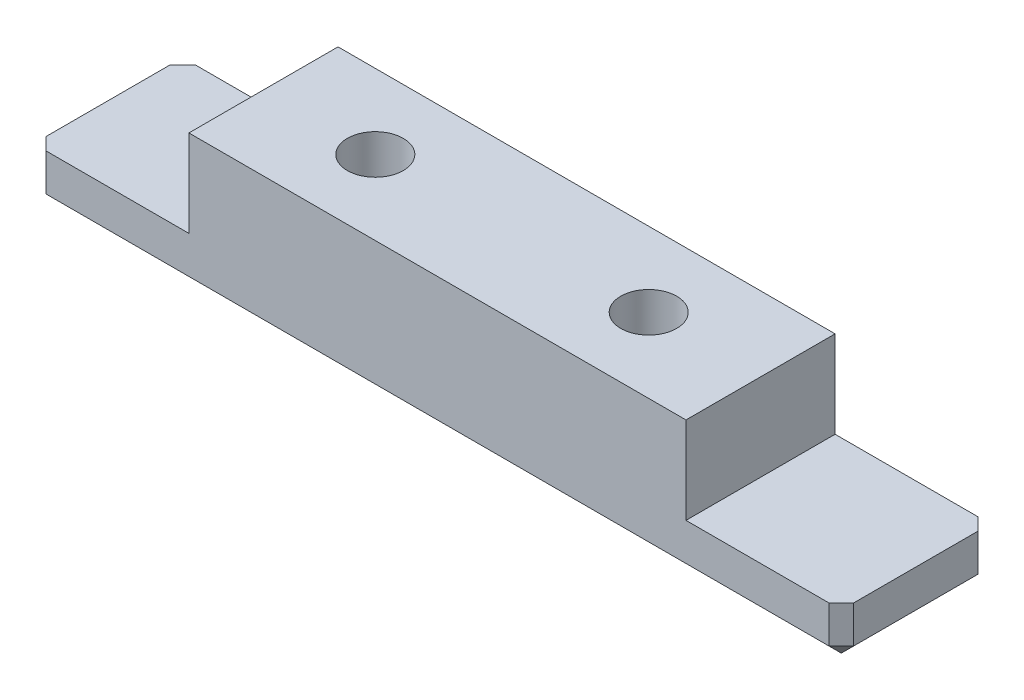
ISO-10303-21;
HEADER;
FILE_DESCRIPTION(('STEP AP214'),'2;1');
FILE_NAME('part.step','',(''),(''),'','','');
FILE_SCHEMA(('AUTOMOTIVE_DESIGN { 1 0 10303 214 1 1 1 1 }'));
ENDSEC;
DATA;
#1=APPLICATION_CONTEXT('core data for automotive mechanical design processes');
#2=APPLICATION_PROTOCOL_DEFINITION('international standard','automotive_design',2000,#1);
#3=PRODUCT_CONTEXT('',#1,'mechanical');
#4=PRODUCT('Part','Part','',(#3));
#5=PRODUCT_RELATED_PRODUCT_CATEGORY('part','',(#4));
#6=PRODUCT_DEFINITION_FORMATION('','',#4);
#7=PRODUCT_DEFINITION_CONTEXT('part definition',#1,'design');
#8=PRODUCT_DEFINITION('design','',#6,#7);
#9=PRODUCT_DEFINITION_SHAPE('','',#8);
#10=(LENGTH_UNIT() NAMED_UNIT(*) SI_UNIT(.MILLI.,.METRE.));
#11=(NAMED_UNIT(*) PLANE_ANGLE_UNIT() SI_UNIT($,.RADIAN.));
#12=(NAMED_UNIT(*) SI_UNIT($,.STERADIAN.) SOLID_ANGLE_UNIT());
#13=UNCERTAINTY_MEASURE_WITH_UNIT(LENGTH_MEASURE(1.E-05),#10,'distance_accuracy_value','');
#14=(GEOMETRIC_REPRESENTATION_CONTEXT(3) GLOBAL_UNCERTAINTY_ASSIGNED_CONTEXT((#13)) GLOBAL_UNIT_ASSIGNED_CONTEXT((#10,
#11,#12)) REPRESENTATION_CONTEXT('',''));
#15=CARTESIAN_POINT('',(0.,0.,0.));
#16=DIRECTION('',(0.,0.,1.));
#17=DIRECTION('',(1.,0.,0.));
#18=AXIS2_PLACEMENT_3D('',#15,#16,#17);
#19=CARTESIAN_POINT('',(20.,-7.,6.00000000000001));
#20=DIRECTION('',(0.,-1.,0.));
#21=DIRECTION('',(0.,0.,-1.));
#22=AXIS2_PLACEMENT_3D('',#19,#20,#21);
#23=PLANE('',#22);
#24=DIRECTION('',(-1.,0.,0.));
#25=VECTOR('',#24,1.);
#26=CARTESIAN_POINT('',(20.,-7.,6.00000000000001));
#27=LINE('',#26,#25);
#28=CARTESIAN_POINT('',(31.5,-7.,6.00000000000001));
#29=VERTEX_POINT('',#28);
#30=CARTESIAN_POINT('',(20.,-7.,6.00000000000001));
#31=VERTEX_POINT('',#30);
#32=EDGE_CURVE('E265',#29,#31,#27,.T.);
#33=ORIENTED_EDGE('',*,*,#32,.F.);
#34=DIRECTION('',(-0.70710678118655,0.,0.707106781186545));
#35=VECTOR('',#34,1.);
#36=CARTESIAN_POINT('',(31.5,-7.,6.00000000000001));
#37=LINE('',#36,#35);
#38=CARTESIAN_POINT('',(32.5,-7.,5.));
#39=VERTEX_POINT('',#38);
#40=EDGE_CURVE('E190',#29,#39,#37,.F.);
#41=ORIENTED_EDGE('',*,*,#40,.T.);
#42=DIRECTION('',(0.,0.,-1.));
#43=VECTOR('',#42,1.);
#44=CARTESIAN_POINT('',(32.5,-7.,6.00000000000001));
#45=LINE('',#44,#43);
#46=CARTESIAN_POINT('',(32.5,-7.,-4.99999999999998));
#47=VERTEX_POINT('',#46);
#48=EDGE_CURVE('E209',#39,#47,#45,.T.);
#49=ORIENTED_EDGE('',*,*,#48,.T.);
#50=DIRECTION('',(-0.707106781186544,0.,-0.707106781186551));
#51=VECTOR('',#50,1.);
#52=CARTESIAN_POINT('',(32.5,-7.,-4.99999999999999));
#53=LINE('',#52,#51);
#54=CARTESIAN_POINT('',(31.5,-7.,-6.00000000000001));
#55=VERTEX_POINT('',#54);
#56=EDGE_CURVE('E136',#47,#55,#53,.T.);
#57=ORIENTED_EDGE('',*,*,#56,.T.);
#58=DIRECTION('',(-1.,0.,0.));
#59=VECTOR('',#58,1.);
#60=CARTESIAN_POINT('',(20.,-7.,-6.00000000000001));
#61=LINE('',#60,#59);
#62=CARTESIAN_POINT('',(20.,-7.,-6.00000000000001));
#63=VERTEX_POINT('',#62);
#64=EDGE_CURVE('E129',#55,#63,#61,.T.);
#65=ORIENTED_EDGE('',*,*,#64,.T.);
#66=DIRECTION('',(0.,0.,-1.));
#67=VECTOR('',#66,1.);
#68=CARTESIAN_POINT('',(20.,-7.,6.00000000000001));
#69=LINE('',#68,#67);
#70=EDGE_CURVE('E133',#31,#63,#69,.T.);
#71=ORIENTED_EDGE('',*,*,#70,.F.);
#72=EDGE_LOOP('',(#33,#41,#49,#57,#65,#71));
#73=FACE_BOUND('',#72,.T.);
#74=ADVANCED_FACE('F31',(#73),#23,.F.);
#75=CARTESIAN_POINT('',(20.,0.,6.00000000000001));
#76=DIRECTION('',(-1.,0.,0.));
#77=DIRECTION('',(0.,0.,1.));
#78=AXIS2_PLACEMENT_3D('',#75,#76,#77);
#79=PLANE('',#78);
#80=DIRECTION('',(0.,1.,0.));
#81=VECTOR('',#80,1.);
#82=CARTESIAN_POINT('',(20.,0.,-6.00000000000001));
#83=LINE('',#82,#81);
#84=CARTESIAN_POINT('',(20.,0.,-6.00000000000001));
#85=VERTEX_POINT('',#84);
#86=EDGE_CURVE('E137',#63,#85,#83,.T.);
#87=ORIENTED_EDGE('',*,*,#86,.T.);
#88=DIRECTION('',(0.,0.,-1.));
#89=VECTOR('',#88,1.);
#90=CARTESIAN_POINT('',(20.,0.,6.00000000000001));
#91=LINE('',#90,#89);
#92=CARTESIAN_POINT('',(20.,0.,6.00000000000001));
#93=VERTEX_POINT('',#92);
#94=EDGE_CURVE('E152',#93,#85,#91,.T.);
#95=ORIENTED_EDGE('',*,*,#94,.F.);
#96=DIRECTION('',(0.,1.,0.));
#97=VECTOR('',#96,1.);
#98=CARTESIAN_POINT('',(20.,0.,6.00000000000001));
#99=LINE('',#98,#97);
#100=EDGE_CURVE('E150',#31,#93,#99,.T.);
#101=ORIENTED_EDGE('',*,*,#100,.F.);
#102=ORIENTED_EDGE('',*,*,#70,.T.);
#103=EDGE_LOOP('',(#87,#95,#101,#102));
#104=FACE_BOUND('',#103,.T.);
#105=ADVANCED_FACE('F149',(#104),#79,.F.);
#106=CARTESIAN_POINT('',(-20.,0.,6.00000000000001));
#107=DIRECTION('',(0.,-1.,0.));
#108=DIRECTION('',(1.,0.,0.));
#109=AXIS2_PLACEMENT_3D('',#106,#107,#108);
#110=PLANE('',#109);
#111=CARTESIAN_POINT('',(-11.,0.,0.));
#112=DIRECTION('',(0.,-1.,0.));
#113=DIRECTION('',(0.,0.,-1.));
#114=AXIS2_PLACEMENT_3D('',#111,#112,#113);
#115=CIRCLE('',#114,2.25);
#116=CARTESIAN_POINT('',(-11.,0.,-2.25));
#117=VERTEX_POINT('',#116);
#118=EDGE_CURVE('E464',#117,#117,#115,.T.);
#119=ORIENTED_EDGE('',*,*,#118,.T.);
#120=EDGE_LOOP('',(#119));
#121=FACE_BOUND('',#120,.T.);
#122=CARTESIAN_POINT('',(11.,0.,0.));
#123=DIRECTION('',(0.,-1.,0.));
#124=DIRECTION('',(0.,0.,-1.));
#125=AXIS2_PLACEMENT_3D('',#122,#123,#124);
#126=CIRCLE('',#125,2.25);
#127=CARTESIAN_POINT('',(11.,0.,-2.25));
#128=VERTEX_POINT('',#127);
#129=EDGE_CURVE('E234',#128,#128,#126,.T.);
#130=ORIENTED_EDGE('',*,*,#129,.T.);
#131=EDGE_LOOP('',(#130));
#132=FACE_BOUND('',#131,.T.);
#133=DIRECTION('',(-1.,0.,0.));
#134=VECTOR('',#133,1.);
#135=CARTESIAN_POINT('',(-20.,0.,-6.00000000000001));
#136=LINE('',#135,#134);
#137=CARTESIAN_POINT('',(-20.,0.,-6.00000000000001));
#138=VERTEX_POINT('',#137);
#139=EDGE_CURVE('E143',#85,#138,#136,.T.);
#140=ORIENTED_EDGE('',*,*,#139,.T.);
#141=DIRECTION('',(0.,0.,-1.));
#142=VECTOR('',#141,1.);
#143=CARTESIAN_POINT('',(-20.,0.,6.00000000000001));
#144=LINE('',#143,#142);
#145=CARTESIAN_POINT('',(-20.,0.,6.00000000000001));
#146=VERTEX_POINT('',#145);
#147=EDGE_CURVE('E156',#146,#138,#144,.T.);
#148=ORIENTED_EDGE('',*,*,#147,.F.);
#149=DIRECTION('',(-1.,0.,0.));
#150=VECTOR('',#149,1.);
#151=CARTESIAN_POINT('',(-20.,0.,6.00000000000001));
#152=LINE('',#151,#150);
#153=EDGE_CURVE('E268',#93,#146,#152,.T.);
#154=ORIENTED_EDGE('',*,*,#153,.F.);
#155=ORIENTED_EDGE('',*,*,#94,.T.);
#156=EDGE_LOOP('',(#140,#148,#154,#155));
#157=FACE_BOUND('',#156,.T.);
#158=ADVANCED_FACE('F284',(#121,#132,#157),#110,.F.);
#159=CARTESIAN_POINT('',(-20.,0.,6.00000000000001));
#160=DIRECTION('',(1.,0.,0.));
#161=DIRECTION('',(0.,0.,-1.));
#162=AXIS2_PLACEMENT_3D('',#159,#160,#161);
#163=PLANE('',#162);
#164=DIRECTION('',(0.,-1.,0.));
#165=VECTOR('',#164,1.);
#166=CARTESIAN_POINT('',(-20.,0.,-6.00000000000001));
#167=LINE('',#166,#165);
#168=CARTESIAN_POINT('',(-20.,-7.00000000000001,-6.00000000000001));
#169=VERTEX_POINT('',#168);
#170=EDGE_CURVE('E262',#138,#169,#167,.T.);
#171=ORIENTED_EDGE('',*,*,#170,.T.);
#172=DIRECTION('',(0.,0.,-1.));
#173=VECTOR('',#172,1.);
#174=CARTESIAN_POINT('',(-20.,-7.00000000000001,6.00000000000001));
#175=LINE('',#174,#173);
#176=CARTESIAN_POINT('',(-20.,-7.00000000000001,6.00000000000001));
#177=VERTEX_POINT('',#176);
#178=EDGE_CURVE('E208',#177,#169,#175,.T.);
#179=ORIENTED_EDGE('',*,*,#178,.F.);
#180=DIRECTION('',(0.,-1.,0.));
#181=VECTOR('',#180,1.);
#182=CARTESIAN_POINT('',(-20.,0.,6.00000000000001));
#183=LINE('',#182,#181);
#184=EDGE_CURVE('E270',#146,#177,#183,.T.);
#185=ORIENTED_EDGE('',*,*,#184,.F.);
#186=ORIENTED_EDGE('',*,*,#147,.T.);
#187=EDGE_LOOP('',(#171,#179,#185,#186));
#188=FACE_BOUND('',#187,.T.);
#189=ADVANCED_FACE('F280',(#188),#163,.F.);
#190=CARTESIAN_POINT('',(-20.,-7.00000000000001,6.00000000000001));
#191=DIRECTION('',(0.,-1.,0.));
#192=DIRECTION('',(1.,0.,0.));
#193=AXIS2_PLACEMENT_3D('',#190,#191,#192);
#194=PLANE('',#193);
#195=DIRECTION('',(0.,0.,-1.));
#196=VECTOR('',#195,1.);
#197=CARTESIAN_POINT('',(-32.5,-7.00000000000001,6.00000000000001));
#198=LINE('',#197,#196);
#199=CARTESIAN_POINT('',(-32.5,-7.00000000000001,4.99999999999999));
#200=VERTEX_POINT('',#199);
#201=CARTESIAN_POINT('',(-32.5,-7.00000000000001,-4.99999999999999));
#202=VERTEX_POINT('',#201);
#203=EDGE_CURVE('E197',#200,#202,#198,.T.);
#204=ORIENTED_EDGE('',*,*,#203,.F.);
#205=DIRECTION('',(-0.707106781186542,0.,-0.707106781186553));
#206=VECTOR('',#205,1.);
#207=CARTESIAN_POINT('',(-31.5,-7.00000000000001,6.00000000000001));
#208=LINE('',#207,#206);
#209=CARTESIAN_POINT('',(-31.5,-7.00000000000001,6.00000000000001));
#210=VERTEX_POINT('',#209);
#211=EDGE_CURVE('E11',#200,#210,#208,.F.);
#212=ORIENTED_EDGE('',*,*,#211,.T.);
#213=DIRECTION('',(-1.,0.,0.));
#214=VECTOR('',#213,1.);
#215=CARTESIAN_POINT('',(-20.,-7.00000000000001,6.00000000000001));
#216=LINE('',#215,#214);
#217=EDGE_CURVE('E272',#177,#210,#216,.T.);
#218=ORIENTED_EDGE('',*,*,#217,.F.);
#219=ORIENTED_EDGE('',*,*,#178,.T.);
#220=DIRECTION('',(-1.,0.,0.));
#221=VECTOR('',#220,1.);
#222=CARTESIAN_POINT('',(-20.,-7.00000000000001,-6.00000000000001));
#223=LINE('',#222,#221);
#224=CARTESIAN_POINT('',(-31.5,-7.00000000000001,-6.00000000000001));
#225=VERTEX_POINT('',#224);
#226=EDGE_CURVE('E201',#169,#225,#223,.T.);
#227=ORIENTED_EDGE('',*,*,#226,.T.);
#228=DIRECTION('',(-0.707106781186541,0.,0.707106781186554));
#229=VECTOR('',#228,1.);
#230=CARTESIAN_POINT('',(-32.5,-7.00000000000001,-4.99999999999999));
#231=LINE('',#230,#229);
#232=EDGE_CURVE('E38',#225,#202,#231,.T.);
#233=ORIENTED_EDGE('',*,*,#232,.T.);
#234=EDGE_LOOP('',(#204,#212,#218,#219,#227,#233));
#235=FACE_BOUND('',#234,.T.);
#236=ADVANCED_FACE('F196',(#235),#194,.F.);
#237=CARTESIAN_POINT('',(-32.5,-7.00000000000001,6.00000000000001));
#238=DIRECTION('',(1.,0.,0.));
#239=DIRECTION('',(0.,0.,-1.));
#240=AXIS2_PLACEMENT_3D('',#237,#238,#239);
#241=PLANE('',#240);
#242=DIRECTION('',(0.,0.,1.));
#243=VECTOR('',#242,1.);
#244=CARTESIAN_POINT('',(-32.5,-10.0048190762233,6.00000000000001));
#245=LINE('',#244,#243);
#246=CARTESIAN_POINT('',(-32.5,-10.0048190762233,-4.99999999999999));
#247=VERTEX_POINT('',#246);
#248=CARTESIAN_POINT('',(-32.5,-10.0048190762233,4.99999999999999));
#249=VERTEX_POINT('',#248);
#250=EDGE_CURVE('E168',#247,#249,#245,.T.);
#251=ORIENTED_EDGE('',*,*,#250,.T.);
#252=DIRECTION('',(0.,1.,0.));
#253=VECTOR('',#252,1.);
#254=CARTESIAN_POINT('',(-32.5,-7.00000000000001,4.99999999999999));
#255=LINE('',#254,#253);
#256=EDGE_CURVE('E171',#249,#200,#255,.T.);
#257=ORIENTED_EDGE('',*,*,#256,.T.);
#258=ORIENTED_EDGE('',*,*,#203,.T.);
#259=DIRECTION('',(0.,-1.,0.));
#260=VECTOR('',#259,1.);
#261=CARTESIAN_POINT('',(-32.5,-11.0048190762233,-4.99999999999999));
#262=LINE('',#261,#260);
#263=EDGE_CURVE('E166',#202,#247,#262,.T.);
#264=ORIENTED_EDGE('',*,*,#263,.T.);
#265=EDGE_LOOP('',(#251,#257,#258,#264));
#266=FACE_BOUND('',#265,.T.);
#267=ADVANCED_FACE('F205',(#266),#241,.F.);
#268=CARTESIAN_POINT('',(32.5,-11.0048190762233,6.00000000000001));
#269=DIRECTION('',(0.,1.,0.));
#270=DIRECTION('',(-1.,0.,0.));
#271=AXIS2_PLACEMENT_3D('',#268,#269,#270);
#272=PLANE('',#271);
#273=CARTESIAN_POINT('',(-11.,-11.0048190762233,0.));
#274=DIRECTION('',(0.,-1.,0.));
#275=DIRECTION('',(0.,0.,-1.));
#276=AXIS2_PLACEMENT_3D('',#273,#274,#275);
#277=CIRCLE('',#276,2.25);
#278=CARTESIAN_POINT('',(-11.,-11.0048190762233,-2.25));
#279=VERTEX_POINT('',#278);
#280=EDGE_CURVE('E467',#279,#279,#277,.T.);
#281=ORIENTED_EDGE('',*,*,#280,.F.);
#282=EDGE_LOOP('',(#281));
#283=FACE_BOUND('',#282,.T.);
#284=CARTESIAN_POINT('',(11.,-11.0048190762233,0.));
#285=DIRECTION('',(0.,-1.,0.));
#286=DIRECTION('',(0.,0.,-1.));
#287=AXIS2_PLACEMENT_3D('',#284,#285,#286);
#288=CIRCLE('',#287,2.25);
#289=CARTESIAN_POINT('',(11.,-11.0048190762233,-2.25));
#290=VERTEX_POINT('',#289);
#291=EDGE_CURVE('E230',#290,#290,#288,.T.);
#292=ORIENTED_EDGE('',*,*,#291,.F.);
#293=EDGE_LOOP('',(#292));
#294=FACE_BOUND('',#293,.T.);
#295=DIRECTION('',(-1.,0.,0.));
#296=VECTOR('',#295,1.);
#297=CARTESIAN_POINT('',(32.5,-11.0048190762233,5.));
#298=LINE('',#297,#296);
#299=CARTESIAN_POINT('',(31.5,-11.0048190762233,5.));
#300=VERTEX_POINT('',#299);
#301=CARTESIAN_POINT('',(-31.5,-11.0048190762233,5.));
#302=VERTEX_POINT('',#301);
#303=EDGE_CURVE('E161',#300,#302,#298,.T.);
#304=ORIENTED_EDGE('',*,*,#303,.T.);
#305=DIRECTION('',(0.,0.,-1.));
#306=VECTOR('',#305,1.);
#307=CARTESIAN_POINT('',(-31.5,-11.0048190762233,6.00000000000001));
#308=LINE('',#307,#306);
#309=CARTESIAN_POINT('',(-31.5,-11.0048190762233,-4.99999999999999));
#310=VERTEX_POINT('',#309);
#311=EDGE_CURVE('E163',#302,#310,#308,.T.);
#312=ORIENTED_EDGE('',*,*,#311,.T.);
#313=DIRECTION('',(1.,0.,0.));
#314=VECTOR('',#313,1.);
#315=CARTESIAN_POINT('',(32.5,-11.0048190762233,-4.99999999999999));
#316=LINE('',#315,#314);
#317=CARTESIAN_POINT('',(31.5,-11.0048190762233,-4.99999999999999));
#318=VERTEX_POINT('',#317);
#319=EDGE_CURVE('E151',#310,#318,#316,.T.);
#320=ORIENTED_EDGE('',*,*,#319,.T.);
#321=DIRECTION('',(0.,0.,1.));
#322=VECTOR('',#321,1.);
#323=CARTESIAN_POINT('',(31.5,-11.0048190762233,6.00000000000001));
#324=LINE('',#323,#322);
#325=EDGE_CURVE('E154',#318,#300,#324,.T.);
#326=ORIENTED_EDGE('',*,*,#325,.T.);
#327=EDGE_LOOP('',(#304,#312,#320,#326));
#328=FACE_BOUND('',#327,.T.);
#329=ADVANCED_FACE('F335',(#283,#294,#328),#272,.F.);
#330=CARTESIAN_POINT('',(32.5,-7.,6.00000000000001));
#331=DIRECTION('',(-1.,0.,0.));
#332=DIRECTION('',(0.,0.,1.));
#333=AXIS2_PLACEMENT_3D('',#330,#331,#332);
#334=PLANE('',#333);
#335=ORIENTED_EDGE('',*,*,#48,.F.);
#336=DIRECTION('',(0.,-1.,0.));
#337=VECTOR('',#336,1.);
#338=CARTESIAN_POINT('',(32.5,-7.,5.));
#339=LINE('',#338,#337);
#340=CARTESIAN_POINT('',(32.5,-10.0048190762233,5.));
#341=VERTEX_POINT('',#340);
#342=EDGE_CURVE('E183',#39,#341,#339,.T.);
#343=ORIENTED_EDGE('',*,*,#342,.T.);
#344=DIRECTION('',(0.,0.,-1.));
#345=VECTOR('',#344,1.);
#346=CARTESIAN_POINT('',(32.5,-10.0048190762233,6.00000000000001));
#347=LINE('',#346,#345);
#348=CARTESIAN_POINT('',(32.5,-10.0048190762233,-4.99999999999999));
#349=VERTEX_POINT('',#348);
#350=EDGE_CURVE('E181',#341,#349,#347,.T.);
#351=ORIENTED_EDGE('',*,*,#350,.T.);
#352=DIRECTION('',(0.,1.,0.));
#353=VECTOR('',#352,1.);
#354=CARTESIAN_POINT('',(32.5,-7.,-4.99999999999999));
#355=LINE('',#354,#353);
#356=EDGE_CURVE('E179',#349,#47,#355,.T.);
#357=ORIENTED_EDGE('',*,*,#356,.T.);
#358=EDGE_LOOP('',(#335,#343,#351,#357));
#359=FACE_BOUND('',#358,.T.);
#360=ADVANCED_FACE('F296',(#359),#334,.F.);
#361=CARTESIAN_POINT('',(32.5,-7.,6.00000000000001));
#362=DIRECTION('',(0.,0.,-1.));
#363=DIRECTION('',(-1.,0.,0.));
#364=AXIS2_PLACEMENT_3D('',#361,#362,#363);
#365=PLANE('',#364);
#366=DIRECTION('',(1.,0.,0.));
#367=VECTOR('',#366,1.);
#368=CARTESIAN_POINT('',(32.5,-10.0048190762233,6.00000000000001));
#369=LINE('',#368,#367);
#370=CARTESIAN_POINT('',(-31.5,-10.0048190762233,6.00000000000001));
#371=VERTEX_POINT('',#370);
#372=CARTESIAN_POINT('',(31.5,-10.0048190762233,6.00000000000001));
#373=VERTEX_POINT('',#372);
#374=EDGE_CURVE('E175',#371,#373,#369,.T.);
#375=ORIENTED_EDGE('',*,*,#374,.T.);
#376=DIRECTION('',(0.,1.,0.));
#377=VECTOR('',#376,1.);
#378=CARTESIAN_POINT('',(31.5,-7.,6.00000000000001));
#379=LINE('',#378,#377);
#380=EDGE_CURVE('E177',#373,#29,#379,.T.);
#381=ORIENTED_EDGE('',*,*,#380,.T.);
#382=ORIENTED_EDGE('',*,*,#32,.T.);
#383=ORIENTED_EDGE('',*,*,#100,.T.);
#384=ORIENTED_EDGE('',*,*,#153,.T.);
#385=ORIENTED_EDGE('',*,*,#184,.T.);
#386=ORIENTED_EDGE('',*,*,#217,.T.);
#387=DIRECTION('',(0.,-1.,0.));
#388=VECTOR('',#387,1.);
#389=CARTESIAN_POINT('',(-31.5,-7.,6.00000000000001));
#390=LINE('',#389,#388);
#391=EDGE_CURVE('E173',#210,#371,#390,.T.);
#392=ORIENTED_EDGE('',*,*,#391,.T.);
#393=EDGE_LOOP('',(#375,#381,#382,#383,#384,#385,#386,#392));
#394=FACE_BOUND('',#393,.T.);
#395=ADVANCED_FACE('F286',(#394),#365,.F.);
#396=CARTESIAN_POINT('',(32.5,-7.,-6.00000000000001));
#397=DIRECTION('',(0.,0.,-1.));
#398=DIRECTION('',(-1.,0.,0.));
#399=AXIS2_PLACEMENT_3D('',#396,#397,#398);
#400=PLANE('',#399);
#401=ORIENTED_EDGE('',*,*,#64,.F.);
#402=DIRECTION('',(0.,-1.,0.));
#403=VECTOR('',#402,1.);
#404=CARTESIAN_POINT('',(31.5,-11.0048190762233,-6.00000000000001));
#405=LINE('',#404,#403);
#406=CARTESIAN_POINT('',(31.5,-10.0048190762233,-6.00000000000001));
#407=VERTEX_POINT('',#406);
#408=EDGE_CURVE('E45',#55,#407,#405,.T.);
#409=ORIENTED_EDGE('',*,*,#408,.T.);
#410=DIRECTION('',(-1.,0.,0.));
#411=VECTOR('',#410,1.);
#412=CARTESIAN_POINT('',(-32.5,-10.0048190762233,-6.00000000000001));
#413=LINE('',#412,#411);
#414=CARTESIAN_POINT('',(-31.5,-10.0048190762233,-6.00000000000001));
#415=VERTEX_POINT('',#414);
#416=EDGE_CURVE('E50',#407,#415,#413,.T.);
#417=ORIENTED_EDGE('',*,*,#416,.T.);
#418=DIRECTION('',(0.,1.,0.));
#419=VECTOR('',#418,1.);
#420=CARTESIAN_POINT('',(-31.5,-7.00000000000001,-6.00000000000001));
#421=LINE('',#420,#419);
#422=EDGE_CURVE('E185',#415,#225,#421,.T.);
#423=ORIENTED_EDGE('',*,*,#422,.T.);
#424=ORIENTED_EDGE('',*,*,#226,.F.);
#425=ORIENTED_EDGE('',*,*,#170,.F.);
#426=ORIENTED_EDGE('',*,*,#139,.F.);
#427=ORIENTED_EDGE('',*,*,#86,.F.);
#428=EDGE_LOOP('',(#401,#409,#417,#423,#424,#425,#426,#427));
#429=FACE_BOUND('',#428,.T.);
#430=ADVANCED_FACE('F141',(#429),#400,.T.);
#431=CARTESIAN_POINT('',(31.5,-7.,6.00000000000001));
#432=DIRECTION('',(-0.707106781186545,0.,-0.70710678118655));
#433=DIRECTION('',(-0.70710678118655,0.,0.707106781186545));
#434=AXIS2_PLACEMENT_3D('',#431,#432,#433);
#435=PLANE('',#434);
#436=ORIENTED_EDGE('',*,*,#40,.F.);
#437=ORIENTED_EDGE('',*,*,#380,.F.);
#438=DIRECTION('',(0.70710678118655,0.,-0.707106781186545));
#439=VECTOR('',#438,1.);
#440=CARTESIAN_POINT('',(31.5,-10.0048190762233,6.00000000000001));
#441=LINE('',#440,#439);
#442=EDGE_CURVE('E138',#341,#373,#441,.F.);
#443=ORIENTED_EDGE('',*,*,#442,.F.);
#444=ORIENTED_EDGE('',*,*,#342,.F.);
#445=EDGE_LOOP('',(#436,#437,#443,#444));
#446=FACE_BOUND('',#445,.T.);
#447=ADVANCED_FACE('F292',(#446),#435,.F.);
#448=CARTESIAN_POINT('',(32.5,-10.0048190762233,6.00000000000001));
#449=DIRECTION('',(-0.707106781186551,0.707106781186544,0.));
#450=DIRECTION('',(-0.707106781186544,-0.707106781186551,0.));
#451=AXIS2_PLACEMENT_3D('',#448,#449,#450);
#452=PLANE('',#451);
#453=DIRECTION('',(0.707106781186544,0.707106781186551,0.));
#454=VECTOR('',#453,1.);
#455=CARTESIAN_POINT('',(32.5,-10.0048190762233,-4.99999999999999));
#456=LINE('',#455,#454);
#457=EDGE_CURVE('E253',#349,#318,#456,.F.);
#458=ORIENTED_EDGE('',*,*,#457,.F.);
#459=ORIENTED_EDGE('',*,*,#350,.F.);
#460=DIRECTION('',(-0.707106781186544,-0.707106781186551,0.));
#461=VECTOR('',#460,1.);
#462=CARTESIAN_POINT('',(32.,-10.5048190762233,5.));
#463=LINE('',#462,#461);
#464=EDGE_CURVE('E256',#300,#341,#463,.F.);
#465=ORIENTED_EDGE('',*,*,#464,.F.);
#466=ORIENTED_EDGE('',*,*,#325,.F.);
#467=EDGE_LOOP('',(#458,#459,#465,#466));
#468=FACE_BOUND('',#467,.T.);
#469=ADVANCED_FACE('F301',(#468),#452,.F.);
#470=CARTESIAN_POINT('',(32.5,-7.,-4.99999999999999));
#471=DIRECTION('',(0.707106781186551,0.,-0.707106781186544));
#472=DIRECTION('',(-0.707106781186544,0.,-0.707106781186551));
#473=AXIS2_PLACEMENT_3D('',#470,#471,#472);
#474=PLANE('',#473);
#475=ORIENTED_EDGE('',*,*,#56,.F.);
#476=ORIENTED_EDGE('',*,*,#356,.F.);
#477=DIRECTION('',(0.707106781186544,0.,0.707106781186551));
#478=VECTOR('',#477,1.);
#479=CARTESIAN_POINT('',(32.5,-10.0048190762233,-4.99999999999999));
#480=LINE('',#479,#478);
#481=EDGE_CURVE('E250',#407,#349,#480,.T.);
#482=ORIENTED_EDGE('',*,*,#481,.F.);
#483=ORIENTED_EDGE('',*,*,#408,.F.);
#484=EDGE_LOOP('',(#475,#476,#482,#483));
#485=FACE_BOUND('',#484,.T.);
#486=ADVANCED_FACE('F308',(#485),#474,.T.);
#487=CARTESIAN_POINT('',(31.5,-10.0048190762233,6.00000000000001));
#488=DIRECTION('',(0.577350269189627,-0.577350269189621,0.57735026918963));
#489=DIRECTION('',(0.70710678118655,0.,-0.707106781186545));
#490=AXIS2_PLACEMENT_3D('',#487,#488,#489);
#491=PLANE('',#490);
#492=ORIENTED_EDGE('',*,*,#464,.T.);
#493=ORIENTED_EDGE('',*,*,#442,.T.);
#494=DIRECTION('',(0.,0.707106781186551,0.707106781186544));
#495=VECTOR('',#494,1.);
#496=CARTESIAN_POINT('',(31.5,-10.0048190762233,6.00000000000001));
#497=LINE('',#496,#495);
#498=EDGE_CURVE('E247',#300,#373,#497,.T.);
#499=ORIENTED_EDGE('',*,*,#498,.F.);
#500=EDGE_LOOP('',(#492,#493,#499));
#501=FACE_BOUND('',#500,.T.);
#502=ADVANCED_FACE('F310',(#501),#491,.T.);
#503=CARTESIAN_POINT('',(32.5,-10.0048190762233,-4.99999999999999));
#504=DIRECTION('',(0.577350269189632,-0.577350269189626,-0.577350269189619));
#505=DIRECTION('',(0.707106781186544,0.707106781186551,0.));
#506=AXIS2_PLACEMENT_3D('',#503,#504,#505);
#507=PLANE('',#506);
#508=ORIENTED_EDGE('',*,*,#481,.T.);
#509=ORIENTED_EDGE('',*,*,#457,.T.);
#510=DIRECTION('',(0.,0.707106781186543,-0.707106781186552));
#511=VECTOR('',#510,1.);
#512=CARTESIAN_POINT('',(31.5,-10.5048190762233,-5.5));
#513=LINE('',#512,#511);
#514=EDGE_CURVE('E244',#407,#318,#513,.F.);
#515=ORIENTED_EDGE('',*,*,#514,.F.);
#516=EDGE_LOOP('',(#508,#509,#515));
#517=FACE_BOUND('',#516,.T.);
#518=ADVANCED_FACE('F306',(#517),#507,.T.);
#519=CARTESIAN_POINT('',(-31.5,-7.,6.00000000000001));
#520=DIRECTION('',(0.707106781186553,0.,-0.707106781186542));
#521=DIRECTION('',(-0.707106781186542,0.,-0.707106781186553));
#522=AXIS2_PLACEMENT_3D('',#519,#520,#521);
#523=PLANE('',#522);
#524=ORIENTED_EDGE('',*,*,#211,.F.);
#525=ORIENTED_EDGE('',*,*,#256,.F.);
#526=DIRECTION('',(0.707106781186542,0.,0.707106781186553));
#527=VECTOR('',#526,1.);
#528=CARTESIAN_POINT('',(-32.5,-10.0048190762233,4.99999999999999));
#529=LINE('',#528,#527);
#530=EDGE_CURVE('E242',#371,#249,#529,.F.);
#531=ORIENTED_EDGE('',*,*,#530,.F.);
#532=ORIENTED_EDGE('',*,*,#391,.F.);
#533=EDGE_LOOP('',(#524,#525,#531,#532));
#534=FACE_BOUND('',#533,.T.);
#535=ADVANCED_FACE('F374',(#534),#523,.F.);
#536=CARTESIAN_POINT('',(32.5,-10.0048190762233,6.00000000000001));
#537=DIRECTION('',(0.,0.707106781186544,-0.707106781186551));
#538=DIRECTION('',(0.,0.707106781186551,0.707106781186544));
#539=AXIS2_PLACEMENT_3D('',#536,#537,#538);
#540=PLANE('',#539);
#541=ORIENTED_EDGE('',*,*,#498,.T.);
#542=ORIENTED_EDGE('',*,*,#374,.F.);
#543=DIRECTION('',(0.,-0.707106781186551,-0.707106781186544));
#544=VECTOR('',#543,1.);
#545=CARTESIAN_POINT('',(-31.5,-10.5048190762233,5.5));
#546=LINE('',#545,#544);
#547=EDGE_CURVE('E239',#302,#371,#546,.F.);
#548=ORIENTED_EDGE('',*,*,#547,.F.);
#549=ORIENTED_EDGE('',*,*,#303,.F.);
#550=EDGE_LOOP('',(#541,#542,#548,#549));
#551=FACE_BOUND('',#550,.T.);
#552=ADVANCED_FACE('F385',(#551),#540,.F.);
#553=CARTESIAN_POINT('',(32.5,-11.0048190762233,-4.99999999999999));
#554=DIRECTION('',(0.,-0.707106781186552,-0.707106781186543));
#555=DIRECTION('',(0.,0.707106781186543,-0.707106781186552));
#556=AXIS2_PLACEMENT_3D('',#553,#554,#555);
#557=PLANE('',#556);
#558=ORIENTED_EDGE('',*,*,#514,.T.);
#559=ORIENTED_EDGE('',*,*,#319,.F.);
#560=DIRECTION('',(0.,-0.707106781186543,0.707106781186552));
#561=VECTOR('',#560,1.);
#562=CARTESIAN_POINT('',(-31.5,-11.0048190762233,-4.99999999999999));
#563=LINE('',#562,#561);
#564=EDGE_CURVE('E219',#415,#310,#563,.T.);
#565=ORIENTED_EDGE('',*,*,#564,.F.);
#566=ORIENTED_EDGE('',*,*,#416,.F.);
#567=EDGE_LOOP('',(#558,#559,#565,#566));
#568=FACE_BOUND('',#567,.T.);
#569=ADVANCED_FACE('F394',(#568),#557,.T.);
#570=CARTESIAN_POINT('',(-32.5,-7.00000000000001,-4.99999999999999));
#571=DIRECTION('',(-0.707106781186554,0.,-0.707106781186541));
#572=DIRECTION('',(-0.707106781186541,0.,0.707106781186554));
#573=AXIS2_PLACEMENT_3D('',#570,#571,#572);
#574=PLANE('',#573);
#575=ORIENTED_EDGE('',*,*,#232,.F.);
#576=ORIENTED_EDGE('',*,*,#422,.F.);
#577=DIRECTION('',(0.707106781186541,0.,-0.707106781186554));
#578=VECTOR('',#577,1.);
#579=CARTESIAN_POINT('',(-32.,-10.0048190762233,-5.49999999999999));
#580=LINE('',#579,#578);
#581=EDGE_CURVE('E213',#247,#415,#580,.T.);
#582=ORIENTED_EDGE('',*,*,#581,.F.);
#583=ORIENTED_EDGE('',*,*,#263,.F.);
#584=EDGE_LOOP('',(#575,#576,#582,#583));
#585=FACE_BOUND('',#584,.T.);
#586=ADVANCED_FACE('F211',(#585),#574,.T.);
#587=CARTESIAN_POINT('',(-32.5,-10.0048190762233,4.99999999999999));
#588=DIRECTION('',(-0.577350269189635,-0.577350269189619,0.577350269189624));
#589=DIRECTION('',(0.707106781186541,0.,0.707106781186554));
#590=AXIS2_PLACEMENT_3D('',#587,#588,#589);
#591=PLANE('',#590);
#592=ORIENTED_EDGE('',*,*,#547,.T.);
#593=ORIENTED_EDGE('',*,*,#530,.T.);
#594=DIRECTION('',(-0.707106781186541,0.707106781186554,0.));
#595=VECTOR('',#594,1.);
#596=CARTESIAN_POINT('',(-32.5,-10.0048190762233,4.99999999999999));
#597=LINE('',#596,#595);
#598=EDGE_CURVE('E220',#302,#249,#597,.T.);
#599=ORIENTED_EDGE('',*,*,#598,.F.);
#600=EDGE_LOOP('',(#592,#593,#599));
#601=FACE_BOUND('',#600,.T.);
#602=ADVANCED_FACE('F412',(#601),#591,.T.);
#603=CARTESIAN_POINT('',(-31.5,-11.0048190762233,-4.99999999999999));
#604=DIRECTION('',(-0.577350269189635,-0.577350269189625,-0.577350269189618));
#605=DIRECTION('',(0.707106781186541,-0.707106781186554,0.));
#606=AXIS2_PLACEMENT_3D('',#603,#604,#605);
#607=PLANE('',#606);
#608=ORIENTED_EDGE('',*,*,#581,.T.);
#609=ORIENTED_EDGE('',*,*,#564,.T.);
#610=DIRECTION('',(0.707106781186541,-0.707106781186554,0.));
#611=VECTOR('',#610,1.);
#612=CARTESIAN_POINT('',(-31.5,-11.0048190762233,-4.99999999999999));
#613=LINE('',#612,#611);
#614=EDGE_CURVE('E225',#247,#310,#613,.T.);
#615=ORIENTED_EDGE('',*,*,#614,.F.);
#616=EDGE_LOOP('',(#608,#609,#615));
#617=FACE_BOUND('',#616,.T.);
#618=ADVANCED_FACE('F228',(#617),#607,.T.);
#619=CARTESIAN_POINT('',(-31.5,-11.0048190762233,6.00000000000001));
#620=DIRECTION('',(0.707106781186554,0.707106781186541,0.));
#621=DIRECTION('',(-0.707106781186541,0.707106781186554,0.));
#622=AXIS2_PLACEMENT_3D('',#619,#620,#621);
#623=PLANE('',#622);
#624=ORIENTED_EDGE('',*,*,#598,.T.);
#625=ORIENTED_EDGE('',*,*,#250,.F.);
#626=ORIENTED_EDGE('',*,*,#614,.T.);
#627=ORIENTED_EDGE('',*,*,#311,.F.);
#628=EDGE_LOOP('',(#624,#625,#626,#627));
#629=FACE_BOUND('',#628,.T.);
#630=ADVANCED_FACE('F223',(#629),#623,.F.);
#631=CARTESIAN_POINT('',(11.,-11.0048190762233,0.));
#632=DIRECTION('',(0.,-1.,0.));
#633=DIRECTION('',(0.,0.,-1.));
#634=AXIS2_PLACEMENT_3D('',#631,#632,#633);
#635=CYLINDRICAL_SURFACE('',#634,2.25);
#636=ORIENTED_EDGE('',*,*,#129,.F.);
#637=EDGE_LOOP('',(#636));
#638=FACE_BOUND('',#637,.T.);
#639=ORIENTED_EDGE('',*,*,#291,.T.);
#640=EDGE_LOOP('',(#639));
#641=FACE_BOUND('',#640,.T.);
#642=ADVANCED_FACE('F438',(#638,#641),#635,.F.);
#643=CARTESIAN_POINT('',(-11.,-11.0048190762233,0.));
#644=DIRECTION('',(0.,-1.,0.));
#645=DIRECTION('',(0.,0.,-1.));
#646=AXIS2_PLACEMENT_3D('',#643,#644,#645);
#647=CYLINDRICAL_SURFACE('',#646,2.25);
#648=ORIENTED_EDGE('',*,*,#118,.F.);
#649=EDGE_LOOP('',(#648));
#650=FACE_BOUND('',#649,.T.);
#651=ORIENTED_EDGE('',*,*,#280,.T.);
#652=EDGE_LOOP('',(#651));
#653=FACE_BOUND('',#652,.T.);
#654=ADVANCED_FACE('F447',(#650,#653),#647,.F.);
#655=CLOSED_SHELL('',(#74,#105,#158,#189,#236,#267,#329,#360,#395,#430,#447,#469,#486,#502,#518,
#535,#552,#569,#586,#602,#618,#630,#642,#654));
#656=MANIFOLD_SOLID_BREP('B2',#655);
#657=ADVANCED_BREP_SHAPE_REPRESENTATION('',(#18,#656),#14);
#658=SHAPE_DEFINITION_REPRESENTATION(#9,#657);
ENDSEC;
END-ISO-10303-21;
